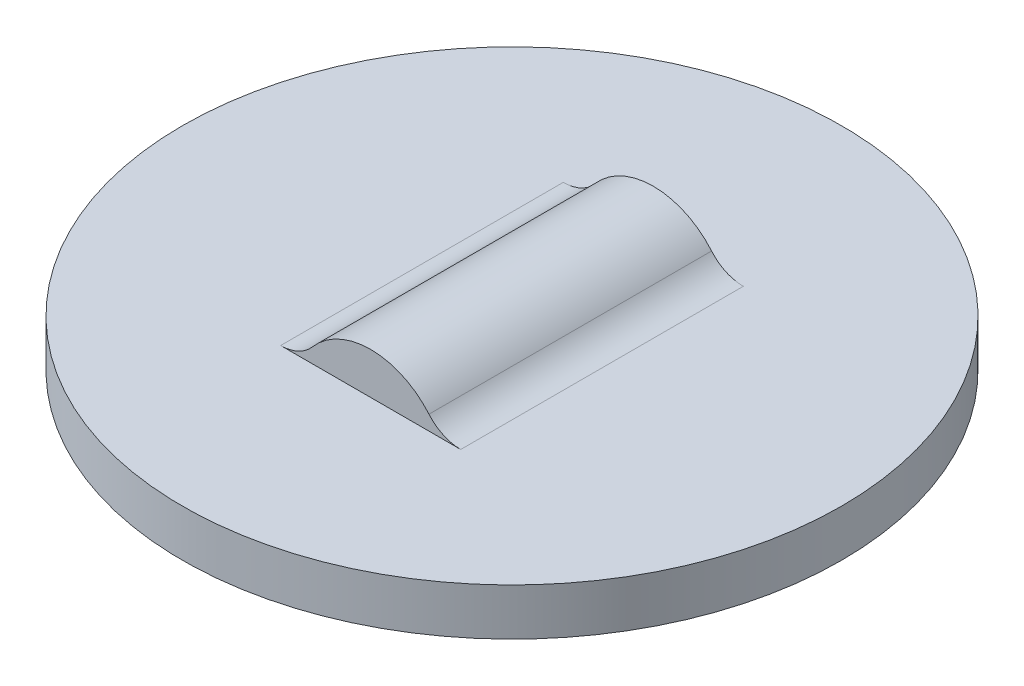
ISO-10303-21;
HEADER;
FILE_DESCRIPTION(('STEP AP214'),'2;1');
FILE_NAME('part.step','',(''),(''),'','','');
FILE_SCHEMA(('AUTOMOTIVE_DESIGN { 1 0 10303 214 1 1 1 1 }'));
ENDSEC;
DATA;
#1=APPLICATION_CONTEXT('core data for automotive mechanical design processes');
#2=APPLICATION_PROTOCOL_DEFINITION('international standard','automotive_design',2000,#1);
#3=PRODUCT_CONTEXT('',#1,'mechanical');
#4=PRODUCT('Part','Part','',(#3));
#5=PRODUCT_RELATED_PRODUCT_CATEGORY('part','',(#4));
#6=PRODUCT_DEFINITION_FORMATION('','',#4);
#7=PRODUCT_DEFINITION_CONTEXT('part definition',#1,'design');
#8=PRODUCT_DEFINITION('design','',#6,#7);
#9=PRODUCT_DEFINITION_SHAPE('','',#8);
#10=(LENGTH_UNIT() NAMED_UNIT(*) SI_UNIT(.MILLI.,.METRE.));
#11=(NAMED_UNIT(*) PLANE_ANGLE_UNIT() SI_UNIT($,.RADIAN.));
#12=(NAMED_UNIT(*) SI_UNIT($,.STERADIAN.) SOLID_ANGLE_UNIT());
#13=UNCERTAINTY_MEASURE_WITH_UNIT(LENGTH_MEASURE(1.E-05),#10,'distance_accuracy_value','');
#14=(GEOMETRIC_REPRESENTATION_CONTEXT(3) GLOBAL_UNCERTAINTY_ASSIGNED_CONTEXT((#13)) GLOBAL_UNIT_ASSIGNED_CONTEXT((#10,
#11,#12)) REPRESENTATION_CONTEXT('',''));
#15=CARTESIAN_POINT('',(0.,0.,0.));
#16=DIRECTION('',(0.,0.,1.));
#17=DIRECTION('',(1.,0.,0.));
#18=AXIS2_PLACEMENT_3D('',#15,#16,#17);
#19=CARTESIAN_POINT('',(0.,-1.6764,13.6144));
#20=DIRECTION('',(0.,0.,-1.));
#21=DIRECTION('',(-1.,0.,0.));
#22=AXIS2_PLACEMENT_3D('',#19,#20,#21);
#23=CYLINDRICAL_SURFACE('',#22,3.683);
#24=CARTESIAN_POINT('',(0.,-1.6764,0.));
#25=DIRECTION('',(0.,0.,-1.));
#26=DIRECTION('',(-1.,0.,0.));
#27=AXIS2_PLACEMENT_3D('',#24,#25,#26);
#28=CIRCLE('',#27,3.683);
#29=CARTESIAN_POINT('',(-2.80724572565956,0.707684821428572,0.));
#30=VERTEX_POINT('',#29);
#31=CARTESIAN_POINT('',(2.80724572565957,0.707684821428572,0.));
#32=VERTEX_POINT('',#31);
#33=EDGE_CURVE('E21',#30,#32,#28,.T.);
#34=ORIENTED_EDGE('',*,*,#33,.F.);
#35=DIRECTION('',(0.,0.,-1.));
#36=VECTOR('',#35,1.);
#37=CARTESIAN_POINT('',(-2.80724572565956,0.707684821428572,13.6144));
#38=LINE('',#37,#36);
#39=CARTESIAN_POINT('',(-2.80724572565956,0.707684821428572,13.6144));
#40=VERTEX_POINT('',#39);
#41=EDGE_CURVE('E80',#30,#40,#38,.F.);
#42=ORIENTED_EDGE('',*,*,#41,.T.);
#43=CARTESIAN_POINT('',(0.,-1.6764,13.6144));
#44=DIRECTION('',(0.,0.,-1.));
#45=DIRECTION('',(-1.,0.,0.));
#46=AXIS2_PLACEMENT_3D('',#43,#44,#45);
#47=CIRCLE('',#46,3.683);
#48=CARTESIAN_POINT('',(2.80724572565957,0.707684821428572,13.6144));
#49=VERTEX_POINT('',#48);
#50=EDGE_CURVE('E101',#40,#49,#47,.T.);
#51=ORIENTED_EDGE('',*,*,#50,.T.);
#52=DIRECTION('',(0.,0.,-1.));
#53=VECTOR('',#52,1.);
#54=CARTESIAN_POINT('',(2.80724572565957,0.707684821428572,13.6144));
#55=LINE('',#54,#53);
#56=EDGE_CURVE('E83',#49,#32,#55,.T.);
#57=ORIENTED_EDGE('',*,*,#56,.T.);
#58=EDGE_LOOP('',(#34,#42,#51,#57));
#59=FACE_BOUND('',#58,.T.);
#60=ADVANCED_FACE('F18',(#59),#23,.T.);
#61=CARTESIAN_POINT('',(-4.33671063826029,2.0066,0.));
#62=DIRECTION('',(0.,0.,-1.));
#63=DIRECTION('',(-1.,0.,0.));
#64=AXIS2_PLACEMENT_3D('',#61,#62,#63);
#65=PLANE('',#64);
#66=CARTESIAN_POINT('',(-4.33671063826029,2.0066,0.));
#67=DIRECTION('',(0.,0.,-1.));
#68=DIRECTION('',(-1.,0.,0.));
#69=AXIS2_PLACEMENT_3D('',#66,#67,#68);
#70=CIRCLE('',#69,2.0066);
#71=CARTESIAN_POINT('',(-4.33671063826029,0.,0.));
#72=VERTEX_POINT('',#71);
#73=EDGE_CURVE('E88',#72,#30,#70,.F.);
#74=ORIENTED_EDGE('',*,*,#73,.T.);
#75=ORIENTED_EDGE('',*,*,#33,.T.);
#76=CARTESIAN_POINT('',(4.33671063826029,2.0066,0.));
#77=DIRECTION('',(0.,0.,-1.));
#78=DIRECTION('',(-1.,0.,0.));
#79=AXIS2_PLACEMENT_3D('',#76,#77,#78);
#80=CIRCLE('',#79,2.0066);
#81=CARTESIAN_POINT('',(4.33671063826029,0.,0.));
#82=VERTEX_POINT('',#81);
#83=EDGE_CURVE('E103',#32,#82,#80,.F.);
#84=ORIENTED_EDGE('',*,*,#83,.T.);
#85=DIRECTION('',(1.,0.,0.));
#86=VECTOR('',#85,1.);
#87=CARTESIAN_POINT('',(4.33671063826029,0.,0.));
#88=LINE('',#87,#86);
#89=EDGE_CURVE('E98',#82,#72,#88,.F.);
#90=ORIENTED_EDGE('',*,*,#89,.T.);
#91=EDGE_LOOP('',(#74,#75,#84,#90));
#92=FACE_BOUND('',#91,.T.);
#93=ADVANCED_FACE('F97',(#92),#65,.T.);
#94=CARTESIAN_POINT('',(-4.33671063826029,2.0066,13.6144));
#95=DIRECTION('',(0.,0.,-1.));
#96=DIRECTION('',(-1.,0.,0.));
#97=AXIS2_PLACEMENT_3D('',#94,#95,#96);
#98=CYLINDRICAL_SURFACE('',#97,2.0066);
#99=CARTESIAN_POINT('',(-4.33671063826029,2.0066,13.6144));
#100=DIRECTION('',(0.,0.,-1.));
#101=DIRECTION('',(-1.,0.,0.));
#102=AXIS2_PLACEMENT_3D('',#99,#100,#101);
#103=CIRCLE('',#102,2.0066);
#104=CARTESIAN_POINT('',(-4.33671063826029,0.,13.6144));
#105=VERTEX_POINT('',#104);
#106=EDGE_CURVE('E94',#105,#40,#103,.F.);
#107=ORIENTED_EDGE('',*,*,#106,.T.);
#108=ORIENTED_EDGE('',*,*,#41,.F.);
#109=ORIENTED_EDGE('',*,*,#73,.F.);
#110=DIRECTION('',(0.,0.,1.));
#111=VECTOR('',#110,1.);
#112=CARTESIAN_POINT('',(-4.33671063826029,0.,13.6144));
#113=LINE('',#112,#111);
#114=EDGE_CURVE('E133',#72,#105,#113,.T.);
#115=ORIENTED_EDGE('',*,*,#114,.T.);
#116=EDGE_LOOP('',(#107,#108,#109,#115));
#117=FACE_BOUND('',#116,.T.);
#118=ADVANCED_FACE('F91',(#117),#98,.F.);
#119=CARTESIAN_POINT('',(-4.33671063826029,2.0066,13.6144));
#120=DIRECTION('',(0.,0.,-1.));
#121=DIRECTION('',(-1.,0.,0.));
#122=AXIS2_PLACEMENT_3D('',#119,#120,#121);
#123=PLANE('',#122);
#124=CARTESIAN_POINT('',(4.33671063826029,2.0066,13.6144));
#125=DIRECTION('',(0.,0.,-1.));
#126=DIRECTION('',(-1.,0.,0.));
#127=AXIS2_PLACEMENT_3D('',#124,#125,#126);
#128=CIRCLE('',#127,2.0066);
#129=CARTESIAN_POINT('',(4.33671063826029,0.,13.6144));
#130=VERTEX_POINT('',#129);
#131=EDGE_CURVE('E105',#130,#49,#128,.T.);
#132=ORIENTED_EDGE('',*,*,#131,.T.);
#133=ORIENTED_EDGE('',*,*,#50,.F.);
#134=ORIENTED_EDGE('',*,*,#106,.F.);
#135=DIRECTION('',(1.,0.,0.));
#136=VECTOR('',#135,1.);
#137=CARTESIAN_POINT('',(4.33671063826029,0.,13.6144));
#138=LINE('',#137,#136);
#139=EDGE_CURVE('E136',#105,#130,#138,.T.);
#140=ORIENTED_EDGE('',*,*,#139,.T.);
#141=EDGE_LOOP('',(#132,#133,#134,#140));
#142=FACE_BOUND('',#141,.T.);
#143=ADVANCED_FACE('F194',(#142),#123,.F.);
#144=CARTESIAN_POINT('',(4.33671063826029,2.0066,13.6144));
#145=DIRECTION('',(0.,0.,-1.));
#146=DIRECTION('',(-1.,0.,0.));
#147=AXIS2_PLACEMENT_3D('',#144,#145,#146);
#148=CYLINDRICAL_SURFACE('',#147,2.0066);
#149=ORIENTED_EDGE('',*,*,#131,.F.);
#150=DIRECTION('',(0.,0.,1.));
#151=VECTOR('',#150,1.);
#152=CARTESIAN_POINT('',(4.33671063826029,0.,13.6144));
#153=LINE('',#152,#151);
#154=EDGE_CURVE('E112',#130,#82,#153,.F.);
#155=ORIENTED_EDGE('',*,*,#154,.T.);
#156=ORIENTED_EDGE('',*,*,#83,.F.);
#157=ORIENTED_EDGE('',*,*,#56,.F.);
#158=EDGE_LOOP('',(#149,#155,#156,#157));
#159=FACE_BOUND('',#158,.T.);
#160=ADVANCED_FACE('F190',(#159),#148,.F.);
#161=CARTESIAN_POINT('',(4.33671063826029,0.,13.6144));
#162=DIRECTION('',(0.,-1.,0.));
#163=DIRECTION('',(1.,0.,0.));
#164=AXIS2_PLACEMENT_3D('',#161,#162,#163);
#165=PLANE('',#164);
#166=ORIENTED_EDGE('',*,*,#139,.F.);
#167=ORIENTED_EDGE('',*,*,#114,.F.);
#168=ORIENTED_EDGE('',*,*,#89,.F.);
#169=ORIENTED_EDGE('',*,*,#154,.F.);
#170=EDGE_LOOP('',(#166,#167,#168,#169));
#171=FACE_BOUND('',#170,.T.);
#172=CARTESIAN_POINT('',(0.,0.,6.8072));
#173=DIRECTION('',(0.,-1.,0.));
#174=DIRECTION('',(1.,0.,0.));
#175=AXIS2_PLACEMENT_3D('',#172,#173,#174);
#176=CIRCLE('',#175,15.875);
#177=CARTESIAN_POINT('',(15.875,0.,6.8072));
#178=VERTEX_POINT('',#177);
#179=EDGE_CURVE('E108',#178,#178,#176,.T.);
#180=ORIENTED_EDGE('',*,*,#179,.F.);
#181=EDGE_LOOP('',(#180));
#182=FACE_BOUND('',#181,.T.);
#183=ADVANCED_FACE('F186',(#171,#182),#165,.F.);
#184=CARTESIAN_POINT('',(0.,-1.6764,0.));
#185=DIRECTION('',(0.,0.,1.));
#186=DIRECTION('',(1.,0.,0.));
#187=AXIS2_PLACEMENT_3D('',#184,#185,#186);
#188=CYLINDRICAL_SURFACE('',#187,1.4224);
#189=DIRECTION('',(0.,0.,1.));
#190=VECTOR('',#189,1.);
#191=CARTESIAN_POINT('',(-1.08417765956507,-0.755650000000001,0.));
#192=LINE('',#191,#190);
#193=CARTESIAN_POINT('',(-1.08417765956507,-0.75565,0.));
#194=VERTEX_POINT('',#193);
#195=CARTESIAN_POINT('',(-1.08417765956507,-0.75565,13.6144));
#196=VERTEX_POINT('',#195);
#197=EDGE_CURVE('E120',#194,#196,#192,.T.);
#198=ORIENTED_EDGE('',*,*,#197,.F.);
#199=CARTESIAN_POINT('',(0.,-1.6764,0.));
#200=DIRECTION('',(0.,0.,1.));
#201=DIRECTION('',(1.,0.,0.));
#202=AXIS2_PLACEMENT_3D('',#199,#200,#201);
#203=CIRCLE('',#202,1.4224);
#204=CARTESIAN_POINT('',(1.08417765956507,-0.75565,0.));
#205=VERTEX_POINT('',#204);
#206=EDGE_CURVE('E124',#205,#194,#203,.T.);
#207=ORIENTED_EDGE('',*,*,#206,.F.);
#208=DIRECTION('',(0.,0.,1.));
#209=VECTOR('',#208,1.);
#210=CARTESIAN_POINT('',(1.08417765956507,-0.75565,0.));
#211=LINE('',#210,#209);
#212=CARTESIAN_POINT('',(1.08417765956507,-0.75565,13.6144));
#213=VERTEX_POINT('',#212);
#214=EDGE_CURVE('E111',#213,#205,#211,.F.);
#215=ORIENTED_EDGE('',*,*,#214,.F.);
#216=CARTESIAN_POINT('',(0.,-1.6764,13.6144));
#217=DIRECTION('',(0.,0.,1.));
#218=DIRECTION('',(1.,0.,0.));
#219=AXIS2_PLACEMENT_3D('',#216,#217,#218);
#220=CIRCLE('',#219,1.4224);
#221=EDGE_CURVE('E113',#213,#196,#220,.T.);
#222=ORIENTED_EDGE('',*,*,#221,.T.);
#223=EDGE_LOOP('',(#198,#207,#215,#222));
#224=FACE_BOUND('',#223,.T.);
#225=ADVANCED_FACE('F182',(#224),#188,.F.);
#226=CARTESIAN_POINT('',(0.,0.,6.8072));
#227=DIRECTION('',(0.,-1.,0.));
#228=DIRECTION('',(1.,0.,0.));
#229=AXIS2_PLACEMENT_3D('',#226,#227,#228);
#230=CYLINDRICAL_SURFACE('',#229,15.875);
#231=CARTESIAN_POINT('',(0.,-2.2606,6.8072));
#232=DIRECTION('',(0.,-1.,0.));
#233=DIRECTION('',(1.,0.,0.));
#234=AXIS2_PLACEMENT_3D('',#231,#232,#233);
#235=CIRCLE('',#234,15.875);
#236=CARTESIAN_POINT('',(15.875,-2.2606,6.8072));
#237=VERTEX_POINT('',#236);
#238=EDGE_CURVE('E127',#237,#237,#235,.F.);
#239=ORIENTED_EDGE('',*,*,#238,.T.);
#240=EDGE_LOOP('',(#239));
#241=FACE_BOUND('',#240,.T.);
#242=ORIENTED_EDGE('',*,*,#179,.T.);
#243=EDGE_LOOP('',(#242));
#244=FACE_BOUND('',#243,.T.);
#245=ADVANCED_FACE('F179',(#241,#244),#230,.T.);
#246=CARTESIAN_POINT('',(4.33671063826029,2.0066,0.));
#247=DIRECTION('',(0.,0.,1.));
#248=DIRECTION('',(1.,0.,0.));
#249=AXIS2_PLACEMENT_3D('',#246,#247,#248);
#250=CYLINDRICAL_SURFACE('',#249,4.2672);
#251=CARTESIAN_POINT('',(4.33671063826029,2.0066,0.));
#252=DIRECTION('',(0.,0.,1.));
#253=DIRECTION('',(1.,0.,0.));
#254=AXIS2_PLACEMENT_3D('',#251,#252,#253);
#255=CIRCLE('',#254,4.2672);
#256=CARTESIAN_POINT('',(4.33671063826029,-2.2606,0.));
#257=VERTEX_POINT('',#256);
#258=EDGE_CURVE('E121',#257,#205,#255,.F.);
#259=ORIENTED_EDGE('',*,*,#258,.F.);
#260=DIRECTION('',(0.,0.,1.));
#261=VECTOR('',#260,1.);
#262=CARTESIAN_POINT('',(4.33671063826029,-2.2606,13.6144));
#263=LINE('',#262,#261);
#264=CARTESIAN_POINT('',(4.33671063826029,-2.2606,13.6144));
#265=VERTEX_POINT('',#264);
#266=EDGE_CURVE('E129',#257,#265,#263,.T.);
#267=ORIENTED_EDGE('',*,*,#266,.T.);
#268=CARTESIAN_POINT('',(4.33671063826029,2.0066,13.6144));
#269=DIRECTION('',(0.,0.,1.));
#270=DIRECTION('',(1.,0.,0.));
#271=AXIS2_PLACEMENT_3D('',#268,#269,#270);
#272=CIRCLE('',#271,4.2672);
#273=EDGE_CURVE('E115',#265,#213,#272,.F.);
#274=ORIENTED_EDGE('',*,*,#273,.T.);
#275=ORIENTED_EDGE('',*,*,#214,.T.);
#276=EDGE_LOOP('',(#259,#267,#274,#275));
#277=FACE_BOUND('',#276,.T.);
#278=ADVANCED_FACE('F162',(#277),#250,.T.);
#279=CARTESIAN_POINT('',(4.33671063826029,2.0066,13.6144));
#280=DIRECTION('',(0.,0.,1.));
#281=DIRECTION('',(1.,0.,0.));
#282=AXIS2_PLACEMENT_3D('',#279,#280,#281);
#283=PLANE('',#282);
#284=DIRECTION('',(1.,0.,0.));
#285=VECTOR('',#284,1.);
#286=CARTESIAN_POINT('',(-15.875,-2.2606,13.6144));
#287=LINE('',#286,#285);
#288=CARTESIAN_POINT('',(-4.33671063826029,-2.2606,13.6144));
#289=VERTEX_POINT('',#288);
#290=EDGE_CURVE('E143',#265,#289,#287,.F.);
#291=ORIENTED_EDGE('',*,*,#290,.T.);
#292=CARTESIAN_POINT('',(-4.33671063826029,2.0066,13.6144));
#293=DIRECTION('',(0.,0.,1.));
#294=DIRECTION('',(1.,0.,0.));
#295=AXIS2_PLACEMENT_3D('',#292,#293,#294);
#296=CIRCLE('',#295,4.2672);
#297=EDGE_CURVE('E118',#196,#289,#296,.F.);
#298=ORIENTED_EDGE('',*,*,#297,.F.);
#299=ORIENTED_EDGE('',*,*,#221,.F.);
#300=ORIENTED_EDGE('',*,*,#273,.F.);
#301=EDGE_LOOP('',(#291,#298,#299,#300));
#302=FACE_BOUND('',#301,.T.);
#303=ADVANCED_FACE('F158',(#302),#283,.F.);
#304=CARTESIAN_POINT('',(-4.33671063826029,2.0066,0.));
#305=DIRECTION('',(0.,0.,1.));
#306=DIRECTION('',(1.,0.,0.));
#307=AXIS2_PLACEMENT_3D('',#304,#305,#306);
#308=CYLINDRICAL_SURFACE('',#307,4.2672);
#309=CARTESIAN_POINT('',(-4.33671063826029,2.0066,0.));
#310=DIRECTION('',(0.,0.,1.));
#311=DIRECTION('',(1.,0.,0.));
#312=AXIS2_PLACEMENT_3D('',#309,#310,#311);
#313=CIRCLE('',#312,4.2672);
#314=CARTESIAN_POINT('',(-4.33671063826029,-2.2606,0.));
#315=VERTEX_POINT('',#314);
#316=EDGE_CURVE('E35',#194,#315,#313,.F.);
#317=ORIENTED_EDGE('',*,*,#316,.F.);
#318=ORIENTED_EDGE('',*,*,#197,.T.);
#319=ORIENTED_EDGE('',*,*,#297,.T.);
#320=DIRECTION('',(0.,0.,1.));
#321=VECTOR('',#320,1.);
#322=CARTESIAN_POINT('',(-4.33671063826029,-2.2606,13.6144));
#323=LINE('',#322,#321);
#324=EDGE_CURVE('E27',#289,#315,#323,.F.);
#325=ORIENTED_EDGE('',*,*,#324,.T.);
#326=EDGE_LOOP('',(#317,#318,#319,#325));
#327=FACE_BOUND('',#326,.T.);
#328=ADVANCED_FACE('F151',(#327),#308,.T.);
#329=CARTESIAN_POINT('',(4.33671063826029,2.0066,0.));
#330=DIRECTION('',(0.,0.,1.));
#331=DIRECTION('',(1.,0.,0.));
#332=AXIS2_PLACEMENT_3D('',#329,#330,#331);
#333=PLANE('',#332);
#334=ORIENTED_EDGE('',*,*,#316,.T.);
#335=DIRECTION('',(1.,0.,0.));
#336=VECTOR('',#335,1.);
#337=CARTESIAN_POINT('',(-15.875,-2.2606,0.));
#338=LINE('',#337,#336);
#339=EDGE_CURVE('E11',#315,#257,#338,.T.);
#340=ORIENTED_EDGE('',*,*,#339,.T.);
#341=ORIENTED_EDGE('',*,*,#258,.T.);
#342=ORIENTED_EDGE('',*,*,#206,.T.);
#343=EDGE_LOOP('',(#334,#340,#341,#342));
#344=FACE_BOUND('',#343,.T.);
#345=ADVANCED_FACE('F164',(#344),#333,.T.);
#346=CARTESIAN_POINT('',(-15.875,-2.2606,13.6144));
#347=DIRECTION('',(0.,1.,0.));
#348=DIRECTION('',(0.,0.,1.));
#349=AXIS2_PLACEMENT_3D('',#346,#347,#348);
#350=PLANE('',#349);
#351=ORIENTED_EDGE('',*,*,#324,.F.);
#352=ORIENTED_EDGE('',*,*,#290,.F.);
#353=ORIENTED_EDGE('',*,*,#266,.F.);
#354=ORIENTED_EDGE('',*,*,#339,.F.);
#355=EDGE_LOOP('',(#351,#352,#353,#354));
#356=FACE_BOUND('',#355,.T.);
#357=ORIENTED_EDGE('',*,*,#238,.F.);
#358=EDGE_LOOP('',(#357));
#359=FACE_BOUND('',#358,.T.);
#360=ADVANCED_FACE('F155',(#356,#359),#350,.F.);
#361=CLOSED_SHELL('',(#60,#93,#118,#143,#160,#183,#225,#245,#278,#303,#328,#345,#360));
#362=MANIFOLD_SOLID_BREP('B1',#361);
#363=ADVANCED_BREP_SHAPE_REPRESENTATION('',(#18,#362),#14);
#364=SHAPE_DEFINITION_REPRESENTATION(#9,#363);
ENDSEC;
END-ISO-10303-21;
